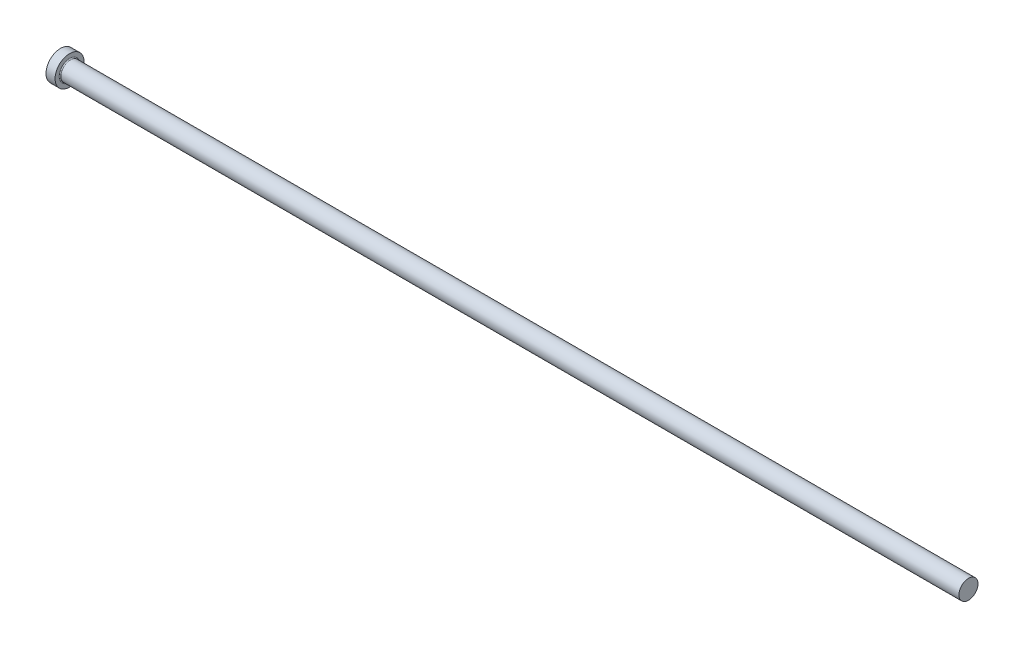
ISO-10303-21;
HEADER;
FILE_DESCRIPTION(('STEP AP214'),'2;1');
FILE_NAME('part.step','',(''),(''),'','','');
FILE_SCHEMA(('AUTOMOTIVE_DESIGN { 1 0 10303 214 1 1 1 1 }'));
ENDSEC;
DATA;
#1=APPLICATION_CONTEXT('core data for automotive mechanical design processes');
#2=APPLICATION_PROTOCOL_DEFINITION('international standard','automotive_design',2000,#1);
#3=PRODUCT_CONTEXT('',#1,'mechanical');
#4=PRODUCT('Part','Part','',(#3));
#5=PRODUCT_RELATED_PRODUCT_CATEGORY('part','',(#4));
#6=PRODUCT_DEFINITION_FORMATION('','',#4);
#7=PRODUCT_DEFINITION_CONTEXT('part definition',#1,'design');
#8=PRODUCT_DEFINITION('design','',#6,#7);
#9=PRODUCT_DEFINITION_SHAPE('','',#8);
#10=(LENGTH_UNIT() NAMED_UNIT(*) SI_UNIT(.MILLI.,.METRE.));
#11=(NAMED_UNIT(*) PLANE_ANGLE_UNIT() SI_UNIT($,.RADIAN.));
#12=(NAMED_UNIT(*) SI_UNIT($,.STERADIAN.) SOLID_ANGLE_UNIT());
#13=UNCERTAINTY_MEASURE_WITH_UNIT(LENGTH_MEASURE(1.E-05),#10,'distance_accuracy_value','');
#14=(GEOMETRIC_REPRESENTATION_CONTEXT(3) GLOBAL_UNCERTAINTY_ASSIGNED_CONTEXT((#13)) GLOBAL_UNIT_ASSIGNED_CONTEXT((#10,
#11,#12)) REPRESENTATION_CONTEXT('',''));
#15=CARTESIAN_POINT('',(0.,0.,0.));
#16=DIRECTION('',(0.,0.,1.));
#17=DIRECTION('',(1.,0.,0.));
#18=AXIS2_PLACEMENT_3D('',#15,#16,#17);
#19=CARTESIAN_POINT('',(0.,0.,0.));
#20=DIRECTION('',(-1.,0.,0.));
#21=DIRECTION('',(0.,-1.,0.));
#22=AXIS2_PLACEMENT_3D('',#19,#20,#21);
#23=PLANE('',#22);
#24=CARTESIAN_POINT('',(0.,0.,0.));
#25=DIRECTION('',(1.,0.,0.));
#26=DIRECTION('',(0.,1.,0.));
#27=AXIS2_PLACEMENT_3D('',#24,#25,#26);
#28=CIRCLE('',#27,8.);
#29=CARTESIAN_POINT('',(0.,8.,0.));
#30=VERTEX_POINT('',#29);
#31=EDGE_CURVE('E24',#30,#30,#28,.T.);
#32=ORIENTED_EDGE('',*,*,#31,.F.);
#33=EDGE_LOOP('',(#32));
#34=FACE_BOUND('',#33,.T.);
#35=ADVANCED_FACE('F13',(#34),#23,.T.);
#36=CARTESIAN_POINT('',(500.,0.,0.));
#37=DIRECTION('',(1.,0.,0.));
#38=DIRECTION('',(0.,1.,0.));
#39=AXIS2_PLACEMENT_3D('',#36,#37,#38);
#40=CYLINDRICAL_SURFACE('',#39,8.);
#41=ORIENTED_EDGE('',*,*,#31,.T.);
#42=EDGE_LOOP('',(#41));
#43=FACE_BOUND('',#42,.T.);
#44=CARTESIAN_POINT('',(5.,0.,0.));
#45=DIRECTION('',(1.,0.,0.));
#46=DIRECTION('',(0.,1.,0.));
#47=AXIS2_PLACEMENT_3D('',#44,#45,#46);
#48=CIRCLE('',#47,8.);
#49=CARTESIAN_POINT('',(5.,8.,0.));
#50=VERTEX_POINT('',#49);
#51=EDGE_CURVE('E28',#50,#50,#48,.T.);
#52=ORIENTED_EDGE('',*,*,#51,.F.);
#53=EDGE_LOOP('',(#52));
#54=FACE_BOUND('',#53,.T.);
#55=ADVANCED_FACE('F50',(#43,#54),#40,.T.);
#56=CARTESIAN_POINT('',(5.,8.,0.));
#57=DIRECTION('',(1.,0.,0.));
#58=DIRECTION('',(0.,1.,0.));
#59=AXIS2_PLACEMENT_3D('',#56,#57,#58);
#60=PLANE('',#59);
#61=CARTESIAN_POINT('',(5.,0.,0.));
#62=DIRECTION('',(1.,0.,0.));
#63=DIRECTION('',(0.,1.,0.));
#64=AXIS2_PLACEMENT_3D('',#61,#62,#63);
#65=CIRCLE('',#64,5.74999999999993);
#66=CARTESIAN_POINT('',(5.,5.74999999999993,0.));
#67=VERTEX_POINT('',#66);
#68=EDGE_CURVE('E8',#67,#67,#65,.F.);
#69=ORIENTED_EDGE('',*,*,#68,.T.);
#70=EDGE_LOOP('',(#69));
#71=FACE_BOUND('',#70,.T.);
#72=ORIENTED_EDGE('',*,*,#51,.T.);
#73=EDGE_LOOP('',(#72));
#74=FACE_BOUND('',#73,.T.);
#75=ADVANCED_FACE('F41',(#71,#74),#60,.T.);
#76=CARTESIAN_POINT('',(500.,0.,0.));
#77=DIRECTION('',(1.,0.,0.));
#78=DIRECTION('',(0.,1.,0.));
#79=AXIS2_PLACEMENT_3D('',#76,#77,#78);
#80=CYLINDRICAL_SURFACE('',#79,5.24999999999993);
#81=CARTESIAN_POINT('',(5.5,0.,0.));
#82=DIRECTION('',(1.,0.,0.));
#83=DIRECTION('',(0.,1.,0.));
#84=AXIS2_PLACEMENT_3D('',#81,#82,#83);
#85=CIRCLE('',#84,5.24999999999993);
#86=CARTESIAN_POINT('',(5.5,5.24999999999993,0.));
#87=VERTEX_POINT('',#86);
#88=EDGE_CURVE('E20',#87,#87,#85,.T.);
#89=ORIENTED_EDGE('',*,*,#88,.T.);
#90=EDGE_LOOP('',(#89));
#91=FACE_BOUND('',#90,.T.);
#92=CARTESIAN_POINT('',(500.,0.,0.));
#93=DIRECTION('',(1.,0.,0.));
#94=DIRECTION('',(0.,1.,0.));
#95=AXIS2_PLACEMENT_3D('',#92,#93,#94);
#96=CIRCLE('',#95,5.24999999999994);
#97=CARTESIAN_POINT('',(500.,5.24999999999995,0.));
#98=VERTEX_POINT('',#97);
#99=EDGE_CURVE('E33',#98,#98,#96,.T.);
#100=ORIENTED_EDGE('',*,*,#99,.F.);
#101=EDGE_LOOP('',(#100));
#102=FACE_BOUND('',#101,.T.);
#103=ADVANCED_FACE('F39',(#91,#102),#80,.T.);
#104=CARTESIAN_POINT('',(500.,5.25,0.));
#105=DIRECTION('',(1.,0.,0.));
#106=DIRECTION('',(0.,1.,0.));
#107=AXIS2_PLACEMENT_3D('',#104,#105,#106);
#108=PLANE('',#107);
#109=ORIENTED_EDGE('',*,*,#99,.T.);
#110=EDGE_LOOP('',(#109));
#111=FACE_BOUND('',#110,.T.);
#112=ADVANCED_FACE('F37',(#111),#108,.T.);
#113=CARTESIAN_POINT('',(5.5,0.,0.));
#114=DIRECTION('',(1.,0.,0.));
#115=DIRECTION('',(0.,1.,0.));
#116=AXIS2_PLACEMENT_3D('',#113,#114,#115);
#117=TOROIDAL_SURFACE('',#116,5.74999999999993,0.5);
#118=ORIENTED_EDGE('',*,*,#68,.F.);
#119=EDGE_LOOP('',(#118));
#120=FACE_BOUND('',#119,.T.);
#121=ORIENTED_EDGE('',*,*,#88,.F.);
#122=EDGE_LOOP('',(#121));
#123=FACE_BOUND('',#122,.T.);
#124=ADVANCED_FACE('F15',(#120,#123),#117,.F.);
#125=CLOSED_SHELL('',(#35,#55,#75,#103,#112,#124));
#126=MANIFOLD_SOLID_BREP('B1',#125);
#127=ADVANCED_BREP_SHAPE_REPRESENTATION('',(#18,#126),#14);
#128=SHAPE_DEFINITION_REPRESENTATION(#9,#127);
ENDSEC;
END-ISO-10303-21;
